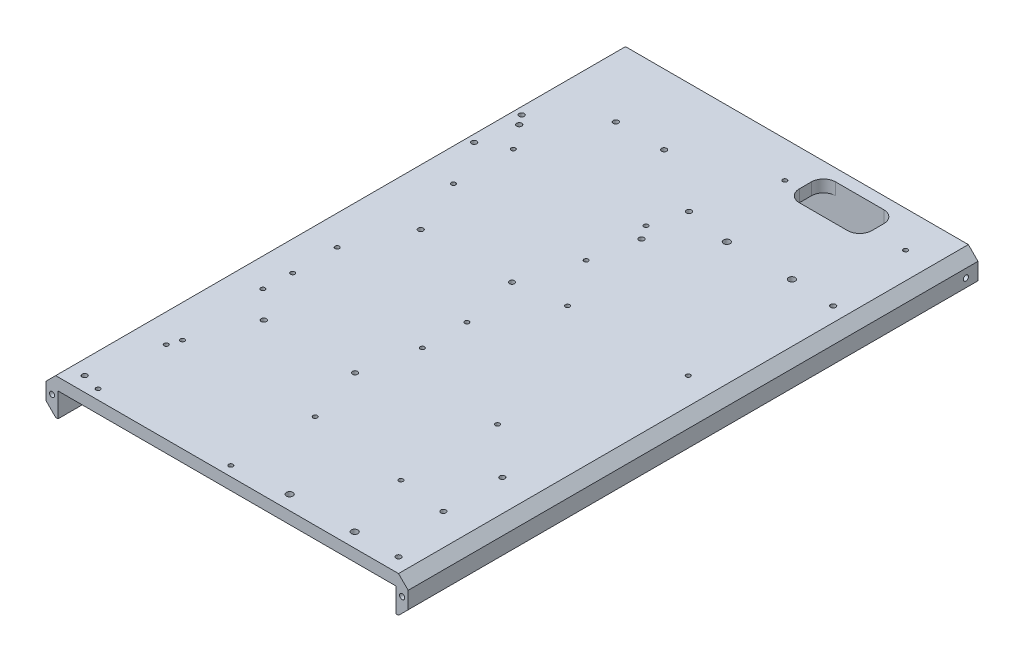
from build123d import *

# Parameters (mm, degrees)
SKETCH1_W                 = 190.5
SKETCH1_H                 = 19.05
BOSS_EXTRUDE1_DEPTH       = 299.72
SKETCH3_W                 = 177.8
SKETCH3_H                 = 306.691161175
CUT_EXTRUDE1_DEPTH        = 12.7
F_1_4_CLEARANCE_HOLE1_D   = 6.7564
CHAMFER1_SIZE             = 5.08
FILLET1_R                 = 6.35
CUT_EXTRUDE3_DEPTH        = 315.747408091
CUT_EXTRUDE3_DEPTH_BACK   = 315.747408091
DIN_RAIL_D                = 2.7051
POWER_SUPPLY_D            = 3.4544
SECONDLEVEL_D             = 2.7051
RACM_HOLES_D              = 2.2606
CRYDOM_D                  = 2.7051
DI808_D                   = 2.2606
SHUNT_D                   = 2.7051
F_4_40_TAPPED_HOLE1_D     = 2.2606
MOXA_D                    = 2.7051
F_6_32_TAPPED_HOLE3_D     = 2.7051
F_6_32_TAPPED_HOLE3_DEPTH = 9.398
F_6_32_TAPPED_HOLE3_TIP   = 0.81269403
F_6_32_TAPPED_HOLE1_D     = 2.7051
F_6_32_TAPPED_HOLE1_DEPTH = 9.398
F_6_32_TAPPED_HOLE1_TIP   = 0.81269403
F_6_32_TAPPED_HOLE4_D     = 2.7051
F_6_32_TAPPED_HOLE4_DEPTH = 9.398
F_6_32_TAPPED_HOLE4_TIP   = 0.81269403


with BuildPart() as part:
    # Sketch1 → Boss-Extrude1 (new body)
    with BuildSketch(Plane.XY):
        with Locations((0, -9.525)):
            Rectangle(SKETCH1_W, SKETCH1_H)
    extrude(amount=BOSS_EXTRUDE1_DEPTH)

    # Sketch3 → Cut-Extrude1 (cut)
    with BuildSketch(Plane.XZ.offset(19.05)):
        with Locations((0, 159.695580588)):
            Rectangle(SKETCH3_W, SKETCH3_H)
    extrude(amount=-CUT_EXTRUDE1_DEPTH, mode=Mode.SUBTRACT)

    # 1_4 Clearance Hole1 (through all)
    with Locations(Plane.XY.offset(6.35)):
        with Locations((-76.2, -12.7), (76.2, -12.7), (0, -12.7)):
            Hole(F_1_4_CLEARANCE_HOLE1_D / 2)

    # Chamfer1
    chamfer1_edges = [part.edges().sort_by_distance(p)[0] for p in [
        (-95.25, 0, 149.86),
        (95.25, 0, 149.86),
        (95.25, -19.05, 149.86),
        (-95.25, -19.05, 149.86),
    ]]
    chamfer(chamfer1_edges, length=CHAMFER1_SIZE)

    # Fillet1
    fillet1_edges = [part.edges().sort_by_distance(p)[0] for p in [
        (-88.9, -12.7, 6.35),
        (88.9, -12.7, 6.35),
    ]]
    fillet(fillet1_edges, radius=FILLET1_R)

    # Sketch11 → Cut-Extrude3 (cut, two sides: drawn at the far end of the back side and taken through both)
    with BuildSketch(Plane.XZ.offset(6.35).offset(-CUT_EXTRUDE3_DEPTH_BACK)):
        with BuildLine():
            Line((26.67, 25.4), (52.07, 25.4))
            ThreePointArc((52.07, 25.4), (56.560128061, 23.540128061), (58.42, 19.05))
            Line((58.42, 19.05), (58.42, 12.7))
            ThreePointArc((58.42, 12.7), (56.560128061, 8.209871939), (52.07, 6.35))
            Line((52.07, 6.35), (26.67, 6.35))
            ThreePointArc((26.67, 6.35), (22.179871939, 8.209871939), (20.32, 12.7))
            Line((20.32, 12.7), (20.32, 19.05))
            ThreePointArc((20.32, 19.05), (22.179871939, 23.540128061), (26.67, 25.4))
        make_face()
    extrude(amount=CUT_EXTRUDE3_DEPTH + CUT_EXTRUDE3_DEPTH_BACK, mode=Mode.SUBTRACT)

    # DIN_Rail (through all)
    with Locations(Plane.XZ.offset(6.35)):
        with Locations((-58.42, 36.83), (-33.02, 36.83)):
            Hole(DIN_RAIL_D / 2)

    # Power_Supply (through all)
    with Locations(Plane.XZ.offset(6.35)):
        with Locations((25.4, 292.23), (59.6, 62.23), (25.4, 62.23), (59.6, 292.23)):
            Hole(POWER_SUPPLY_D / 2)

    # SecondLevel (through all)
    with Locations(Plane(origin=(0, -6.35, 0), x_dir=(-1, 0, 0), z_dir=(0, -1, 0))):
        with Locations((-82.55, -63.5), (82.55, -292.1), (-82.55, -292.1), (82.55, -63.5)):
            Hole(SECONDLEVEL_D / 2)

    # RACM_Holes (through all)
    with Locations(Plane.XZ.offset(6.35)):
        with Locations((-72.975, 294.59), (-3.175, 250.19), (-72.975, 250.19), (-3.175, 294.59), (-72.975, 107.7), (-3.175, 76.2), (-72.975, 76.2), (-3.175, 107.7), (-74.55, 190.659), (-6.35, 167.259), (-74.55, 167.259), (-6.35, 190.659)):
            Hole(RACM_HOLES_D / 2)

    # crydom (through all)
    with Locations(Plane(origin=(0, -6.35, 0), x_dir=(-1, 0, 0), z_dir=(0, -1, 0))):
        with Locations((12.7, -137.16), (60.7, -137.16), (12.7, -219.71), (60.7, -219.71)):
            Hole(CRYDOM_D / 2)

    # DI808 (through all)
    with Locations(Plane(origin=(0, 0, 0), x_dir=(1, 0, 0), z_dir=(0, 1, 0))):
        with Locations((-75.184, -205.74), (48.26, -256.54), (-75.184, -256.54), (48.26, -205.74)):
            Hole(DI808_D / 2)

    # Shunt (through all)
    with Locations(Plane(origin=(0, 0, 0), x_dir=(1, 0, 0), z_dir=(0, 1, 0))):
        with Locations((73.66, -259.6), (73.66, -228.6)):
            Hole(SHUNT_D / 2)

    # 4-40 Tapped Hole1 (through all)
    with Locations(Plane(origin=(0, 0, 0), x_dir=(1, 0, 0), z_dir=(0, 1, 0))):
        with Locations((12.7, -19.05), (12.7, -133.35), (76.2, -19.05), (76.2, -133.35)):
            Hole(F_4_40_TAPPED_HOLE1_D / 2)

    # Moxa (through all)
    with Locations(Plane(origin=(0, 0, 0), x_dir=(1, 0, 0), z_dir=(0, 1, 0))):
        with Locations((-86.36, -58.42), (1.64, -83.42), (-86.36, -83.42), (1.64, -58.42)):
            Hole(MOXA_D / 2)

    # 6-32 Tapped Hole3
    with Locations(Plane.ZY.offset(95.25)):
        with Locations((6.35, -9.525)):
            Hole(F_6_32_TAPPED_HOLE3_D / 2, depth=F_6_32_TAPPED_HOLE3_DEPTH)
            with Locations((0, 0, -(F_6_32_TAPPED_HOLE3_DEPTH + F_6_32_TAPPED_HOLE3_TIP / 2))):  # 118° drill point
                Cone(0, F_6_32_TAPPED_HOLE3_D / 2, F_6_32_TAPPED_HOLE3_TIP, mode=Mode.SUBTRACT)

    # 6-32 Tapped Hole1
    with Locations(Plane(origin=(95.25, 0, 0), x_dir=(0, 0, -1), z_dir=(1, 0, 0))):
        with Locations((-6.35, -9.525)):
            Hole(F_6_32_TAPPED_HOLE1_D / 2, depth=F_6_32_TAPPED_HOLE1_DEPTH)
            with Locations((0, 0, -(F_6_32_TAPPED_HOLE1_DEPTH + F_6_32_TAPPED_HOLE1_TIP / 2))):  # 118° drill point
                Cone(0, F_6_32_TAPPED_HOLE1_D / 2, F_6_32_TAPPED_HOLE1_TIP, mode=Mode.SUBTRACT)

    # 6-32 Tapped Hole4
    with Locations(Plane.XY.offset(299.72)):
        with Locations((-92.075, -9.525), (92.075, -9.525)):
            Hole(F_6_32_TAPPED_HOLE4_D / 2, depth=F_6_32_TAPPED_HOLE4_DEPTH)
            with Locations((0, 0, -(F_6_32_TAPPED_HOLE4_DEPTH + F_6_32_TAPPED_HOLE4_TIP / 2))):  # 118° drill point
                Cone(0, F_6_32_TAPPED_HOLE4_D / 2, F_6_32_TAPPED_HOLE4_TIP, mode=Mode.SUBTRACT)


solid = part.part
